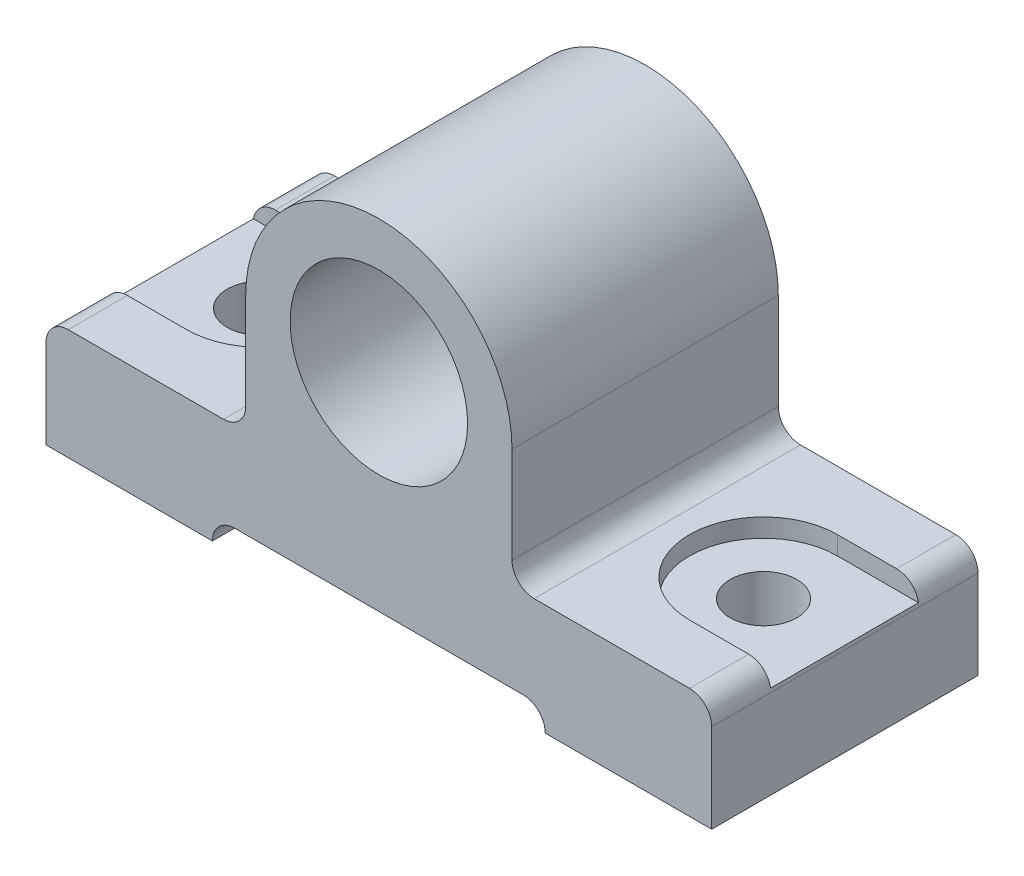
ISO-10303-21;
HEADER;
FILE_DESCRIPTION(('STEP AP214'),'2;1');
FILE_NAME('part.step','',(''),(''),'','','');
FILE_SCHEMA(('AUTOMOTIVE_DESIGN { 1 0 10303 214 1 1 1 1 }'));
ENDSEC;
DATA;
#1=APPLICATION_CONTEXT('core data for automotive mechanical design processes');
#2=APPLICATION_PROTOCOL_DEFINITION('international standard','automotive_design',2000,#1);
#3=PRODUCT_CONTEXT('',#1,'mechanical');
#4=PRODUCT('Part','Part','',(#3));
#5=PRODUCT_RELATED_PRODUCT_CATEGORY('part','',(#4));
#6=PRODUCT_DEFINITION_FORMATION('','',#4);
#7=PRODUCT_DEFINITION_CONTEXT('part definition',#1,'design');
#8=PRODUCT_DEFINITION('design','',#6,#7);
#9=PRODUCT_DEFINITION_SHAPE('','',#8);
#10=(LENGTH_UNIT() NAMED_UNIT(*) SI_UNIT(.MILLI.,.METRE.));
#11=(NAMED_UNIT(*) PLANE_ANGLE_UNIT() SI_UNIT($,.RADIAN.));
#12=(NAMED_UNIT(*) SI_UNIT($,.STERADIAN.) SOLID_ANGLE_UNIT());
#13=UNCERTAINTY_MEASURE_WITH_UNIT(LENGTH_MEASURE(1.E-05),#10,'distance_accuracy_value','');
#14=(GEOMETRIC_REPRESENTATION_CONTEXT(3) GLOBAL_UNCERTAINTY_ASSIGNED_CONTEXT((#13)) GLOBAL_UNIT_ASSIGNED_CONTEXT((#10,
#11,#12)) REPRESENTATION_CONTEXT('',''));
#15=CARTESIAN_POINT('',(0.,0.,0.));
#16=DIRECTION('',(0.,0.,1.));
#17=DIRECTION('',(1.,0.,0.));
#18=AXIS2_PLACEMENT_3D('',#15,#16,#17);
#19=CARTESIAN_POINT('',(0.,0.,-36.));
#20=DIRECTION('',(0.,-1.,0.));
#21=DIRECTION('',(0.,0.,-1.));
#22=AXIS2_PLACEMENT_3D('',#19,#20,#21);
#23=PLANE('',#22);
#24=DIRECTION('',(1.,0.,0.));
#25=VECTOR('',#24,1.);
#26=CARTESIAN_POINT('',(0.,0.,0.));
#27=LINE('',#26,#25);
#28=CARTESIAN_POINT('',(0.,0.,0.));
#29=VERTEX_POINT('',#28);
#30=CARTESIAN_POINT('',(22.5,0.,0.));
#31=VERTEX_POINT('',#30);
#32=EDGE_CURVE('E258',#29,#31,#27,.T.);
#33=ORIENTED_EDGE('',*,*,#32,.F.);
#34=DIRECTION('',(0.,0.,1.));
#35=VECTOR('',#34,1.);
#36=CARTESIAN_POINT('',(0.,0.,-36.));
#37=LINE('',#36,#35);
#38=CARTESIAN_POINT('',(0.,0.,-36.));
#39=VERTEX_POINT('',#38);
#40=EDGE_CURVE('E312',#39,#29,#37,.T.);
#41=ORIENTED_EDGE('',*,*,#40,.F.);
#42=DIRECTION('',(1.,0.,0.));
#43=VECTOR('',#42,1.);
#44=CARTESIAN_POINT('',(0.,0.,-36.));
#45=LINE('',#44,#43);
#46=CARTESIAN_POINT('',(22.5,0.,-36.));
#47=VERTEX_POINT('',#46);
#48=EDGE_CURVE('E286',#39,#47,#45,.T.);
#49=ORIENTED_EDGE('',*,*,#48,.T.);
#50=DIRECTION('',(0.,0.,1.));
#51=VECTOR('',#50,1.);
#52=CARTESIAN_POINT('',(22.5,0.,-36.));
#53=LINE('',#52,#51);
#54=EDGE_CURVE('E324',#47,#31,#53,.T.);
#55=ORIENTED_EDGE('',*,*,#54,.T.);
#56=EDGE_LOOP('',(#33,#41,#49,#55));
#57=FACE_BOUND('',#56,.T.);
#58=CARTESIAN_POINT('',(11.,0.,-18.));
#59=DIRECTION('',(0.,-1.,0.));
#60=DIRECTION('',(0.,0.,-1.));
#61=AXIS2_PLACEMENT_3D('',#58,#59,#60);
#62=CIRCLE('',#61,4.5);
#63=CARTESIAN_POINT('',(11.,0.,-22.5));
#64=VERTEX_POINT('',#63);
#65=EDGE_CURVE('E207',#64,#64,#62,.T.);
#66=ORIENTED_EDGE('',*,*,#65,.F.);
#67=EDGE_LOOP('',(#66));
#68=FACE_BOUND('',#67,.T.);
#69=ADVANCED_FACE('F26',(#57,#68),#23,.T.);
#70=CARTESIAN_POINT('',(11.,12.5,-18.));
#71=DIRECTION('',(0.,1.,0.));
#72=DIRECTION('',(0.,0.,1.));
#73=AXIS2_PLACEMENT_3D('',#70,#71,#72);
#74=PLANE('',#73);
#75=DIRECTION('',(-1.,0.,0.));
#76=VECTOR('',#75,1.);
#77=CARTESIAN_POINT('',(0.,12.5,-8.));
#78=LINE('',#77,#76);
#79=CARTESIAN_POINT('',(11.,12.5,-8.));
#80=VERTEX_POINT('',#79);
#81=CARTESIAN_POINT('',(0.0419601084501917,12.5,-8.));
#82=VERTEX_POINT('',#81);
#83=EDGE_CURVE('E213',#80,#82,#78,.T.);
#84=ORIENTED_EDGE('',*,*,#83,.F.);
#85=CARTESIAN_POINT('',(11.,12.5,-18.));
#86=DIRECTION('',(0.,-1.,0.));
#87=DIRECTION('',(0.,0.,1.));
#88=AXIS2_PLACEMENT_3D('',#85,#86,#87);
#89=CIRCLE('',#88,10.);
#90=CARTESIAN_POINT('',(11.,12.5,-28.));
#91=VERTEX_POINT('',#90);
#92=EDGE_CURVE('E195',#91,#80,#89,.T.);
#93=ORIENTED_EDGE('',*,*,#92,.F.);
#94=DIRECTION('',(1.,0.,0.));
#95=VECTOR('',#94,1.);
#96=CARTESIAN_POINT('',(0.,12.5,-28.));
#97=LINE('',#96,#95);
#98=CARTESIAN_POINT('',(0.0419601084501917,12.5,-28.));
#99=VERTEX_POINT('',#98);
#100=EDGE_CURVE('E41',#99,#91,#97,.T.);
#101=ORIENTED_EDGE('',*,*,#100,.F.);
#102=DIRECTION('',(0.,0.,1.));
#103=VECTOR('',#102,1.);
#104=CARTESIAN_POINT('',(0.0419601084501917,12.5,-36.));
#105=LINE('',#104,#103);
#106=EDGE_CURVE('E386',#82,#99,#105,.F.);
#107=ORIENTED_EDGE('',*,*,#106,.F.);
#108=EDGE_LOOP('',(#84,#93,#101,#107));
#109=FACE_BOUND('',#108,.T.);
#110=CARTESIAN_POINT('',(11.,12.5,-18.));
#111=DIRECTION('',(0.,-1.,0.));
#112=DIRECTION('',(0.,0.,1.));
#113=AXIS2_PLACEMENT_3D('',#110,#111,#112);
#114=CIRCLE('',#113,4.5);
#115=CARTESIAN_POINT('',(11.,12.5,-13.5));
#116=VERTEX_POINT('',#115);
#117=EDGE_CURVE('E470',#116,#116,#114,.T.);
#118=ORIENTED_EDGE('',*,*,#117,.T.);
#119=EDGE_LOOP('',(#118));
#120=FACE_BOUND('',#119,.T.);
#121=ADVANCED_FACE('F464',(#109,#120),#74,.T.);
#122=CARTESIAN_POINT('',(0.,15.,-36.));
#123=DIRECTION('',(0.,1.,0.));
#124=DIRECTION('',(0.,0.,1.));
#125=AXIS2_PLACEMENT_3D('',#122,#123,#124);
#126=PLANE('',#125);
#127=DIRECTION('',(0.,0.,1.));
#128=VECTOR('',#127,1.);
#129=CARTESIAN_POINT('',(3.,15.,-36.));
#130=LINE('',#129,#128);
#131=CARTESIAN_POINT('',(3.,15.,-36.));
#132=VERTEX_POINT('',#131);
#133=CARTESIAN_POINT('',(3.,15.,-28.));
#134=VERTEX_POINT('',#133);
#135=EDGE_CURVE('E352',#132,#134,#130,.T.);
#136=ORIENTED_EDGE('',*,*,#135,.T.);
#137=DIRECTION('',(1.,0.,0.));
#138=VECTOR('',#137,1.);
#139=CARTESIAN_POINT('',(0.,15.,-28.));
#140=LINE('',#139,#138);
#141=CARTESIAN_POINT('',(11.,15.,-28.));
#142=VERTEX_POINT('',#141);
#143=EDGE_CURVE('E211',#134,#142,#140,.T.);
#144=ORIENTED_EDGE('',*,*,#143,.T.);
#145=CARTESIAN_POINT('',(11.,15.,-18.));
#146=DIRECTION('',(0.,-1.,0.));
#147=DIRECTION('',(0.,0.,1.));
#148=AXIS2_PLACEMENT_3D('',#145,#146,#147);
#149=CIRCLE('',#148,10.);
#150=CARTESIAN_POINT('',(11.,15.,-8.));
#151=VERTEX_POINT('',#150);
#152=EDGE_CURVE('E193',#142,#151,#149,.T.);
#153=ORIENTED_EDGE('',*,*,#152,.T.);
#154=DIRECTION('',(-1.,0.,0.));
#155=VECTOR('',#154,1.);
#156=CARTESIAN_POINT('',(0.,15.,-8.));
#157=LINE('',#156,#155);
#158=CARTESIAN_POINT('',(3.,15.,-8.));
#159=VERTEX_POINT('',#158);
#160=EDGE_CURVE('E202',#151,#159,#157,.T.);
#161=ORIENTED_EDGE('',*,*,#160,.T.);
#162=CARTESIAN_POINT('',(3.,15.,0.));
#163=VERTEX_POINT('',#162);
#164=EDGE_CURVE('E351',#159,#163,#130,.T.);
#165=ORIENTED_EDGE('',*,*,#164,.T.);
#166=DIRECTION('',(-1.,0.,0.));
#167=VECTOR('',#166,1.);
#168=CARTESIAN_POINT('',(0.,15.,0.));
#169=LINE('',#168,#167);
#170=CARTESIAN_POINT('',(24.,15.,0.));
#171=VERTEX_POINT('',#170);
#172=EDGE_CURVE('E281',#171,#163,#169,.T.);
#173=ORIENTED_EDGE('',*,*,#172,.F.);
#174=DIRECTION('',(0.,0.,1.));
#175=VECTOR('',#174,1.);
#176=CARTESIAN_POINT('',(24.,15.,-36.));
#177=LINE('',#176,#175);
#178=CARTESIAN_POINT('',(24.,15.,-36.));
#179=VERTEX_POINT('',#178);
#180=EDGE_CURVE('E354',#171,#179,#177,.F.);
#181=ORIENTED_EDGE('',*,*,#180,.T.);
#182=DIRECTION('',(-1.,0.,0.));
#183=VECTOR('',#182,1.);
#184=CARTESIAN_POINT('',(0.,15.,-36.));
#185=LINE('',#184,#183);
#186=EDGE_CURVE('E309',#179,#132,#185,.T.);
#187=ORIENTED_EDGE('',*,*,#186,.T.);
#188=EDGE_LOOP('',(#136,#144,#153,#161,#165,#173,#181,#187));
#189=FACE_BOUND('',#188,.T.);
#190=ADVANCED_FACE('F210',(#189),#126,.T.);
#191=CARTESIAN_POINT('',(3.,12.,-36.));
#192=DIRECTION('',(0.,0.,1.));
#193=DIRECTION('',(1.,0.,0.));
#194=AXIS2_PLACEMENT_3D('',#191,#192,#193);
#195=CYLINDRICAL_SURFACE('',#194,3.);
#196=ORIENTED_EDGE('',*,*,#106,.T.);
#197=CARTESIAN_POINT('',(3.,12.,-28.));
#198=DIRECTION('',(0.,0.,1.));
#199=DIRECTION('',(1.,0.,0.));
#200=AXIS2_PLACEMENT_3D('',#197,#198,#199);
#201=CIRCLE('',#200,3.);
#202=EDGE_CURVE('E11',#99,#134,#201,.F.);
#203=ORIENTED_EDGE('',*,*,#202,.T.);
#204=ORIENTED_EDGE('',*,*,#135,.F.);
#205=CARTESIAN_POINT('',(3.,12.,-36.));
#206=DIRECTION('',(0.,0.,1.));
#207=DIRECTION('',(1.,0.,0.));
#208=AXIS2_PLACEMENT_3D('',#205,#206,#207);
#209=CIRCLE('',#208,3.);
#210=CARTESIAN_POINT('',(0.,12.,-36.));
#211=VERTEX_POINT('',#210);
#212=EDGE_CURVE('E342',#211,#132,#209,.F.);
#213=ORIENTED_EDGE('',*,*,#212,.F.);
#214=DIRECTION('',(0.,0.,1.));
#215=VECTOR('',#214,1.);
#216=CARTESIAN_POINT('',(0.,12.,-36.));
#217=LINE('',#216,#215);
#218=CARTESIAN_POINT('',(0.,12.,0.));
#219=VERTEX_POINT('',#218);
#220=EDGE_CURVE('E356',#219,#211,#217,.F.);
#221=ORIENTED_EDGE('',*,*,#220,.F.);
#222=CARTESIAN_POINT('',(3.,12.,0.));
#223=DIRECTION('',(0.,0.,1.));
#224=DIRECTION('',(1.,0.,0.));
#225=AXIS2_PLACEMENT_3D('',#222,#223,#224);
#226=CIRCLE('',#225,3.);
#227=EDGE_CURVE('E331',#163,#219,#226,.T.);
#228=ORIENTED_EDGE('',*,*,#227,.F.);
#229=ORIENTED_EDGE('',*,*,#164,.F.);
#230=CARTESIAN_POINT('',(3.,12.,-8.));
#231=DIRECTION('',(0.,0.,-1.));
#232=DIRECTION('',(-1.,0.,0.));
#233=AXIS2_PLACEMENT_3D('',#230,#231,#232);
#234=CIRCLE('',#233,3.);
#235=EDGE_CURVE('E34',#159,#82,#234,.F.);
#236=ORIENTED_EDGE('',*,*,#235,.T.);
#237=EDGE_LOOP('',(#196,#203,#204,#213,#221,#228,#229,#236));
#238=FACE_BOUND('',#237,.T.);
#239=ADVANCED_FACE('F389',(#238),#195,.T.);
#240=CARTESIAN_POINT('',(0.,0.,-36.));
#241=DIRECTION('',(-1.,0.,0.));
#242=DIRECTION('',(0.,0.,1.));
#243=AXIS2_PLACEMENT_3D('',#240,#241,#242);
#244=PLANE('',#243);
#245=DIRECTION('',(0.,-1.,0.));
#246=VECTOR('',#245,1.);
#247=CARTESIAN_POINT('',(0.,0.,0.));
#248=LINE('',#247,#246);
#249=EDGE_CURVE('E256',#219,#29,#248,.T.);
#250=ORIENTED_EDGE('',*,*,#249,.F.);
#251=ORIENTED_EDGE('',*,*,#220,.T.);
#252=DIRECTION('',(0.,-1.,0.));
#253=VECTOR('',#252,1.);
#254=CARTESIAN_POINT('',(0.,0.,-36.));
#255=LINE('',#254,#253);
#256=EDGE_CURVE('E284',#211,#39,#255,.T.);
#257=ORIENTED_EDGE('',*,*,#256,.T.);
#258=ORIENTED_EDGE('',*,*,#40,.T.);
#259=EDGE_LOOP('',(#250,#251,#257,#258));
#260=FACE_BOUND('',#259,.T.);
#261=ADVANCED_FACE('F28',(#260),#244,.T.);
#262=CARTESIAN_POINT('',(27.,15.,-36.));
#263=DIRECTION('',(-1.,0.,0.));
#264=DIRECTION('',(0.,0.,1.));
#265=AXIS2_PLACEMENT_3D('',#262,#263,#264);
#266=PLANE('',#265);
#267=DIRECTION('',(0.,-1.,0.));
#268=VECTOR('',#267,1.);
#269=CARTESIAN_POINT('',(27.,15.,-36.));
#270=LINE('',#269,#268);
#271=CARTESIAN_POINT('',(27.,31.,-36.));
#272=VERTEX_POINT('',#271);
#273=CARTESIAN_POINT('',(27.,18.,-36.));
#274=VERTEX_POINT('',#273);
#275=EDGE_CURVE('E306',#272,#274,#270,.T.);
#276=ORIENTED_EDGE('',*,*,#275,.T.);
#277=DIRECTION('',(0.,0.,1.));
#278=VECTOR('',#277,1.);
#279=CARTESIAN_POINT('',(27.,18.,0.));
#280=LINE('',#279,#278);
#281=CARTESIAN_POINT('',(27.,18.,0.));
#282=VERTEX_POINT('',#281);
#283=EDGE_CURVE('E348',#274,#282,#280,.T.);
#284=ORIENTED_EDGE('',*,*,#283,.T.);
#285=DIRECTION('',(0.,-1.,0.));
#286=VECTOR('',#285,1.);
#287=CARTESIAN_POINT('',(27.,15.,0.));
#288=LINE('',#287,#286);
#289=CARTESIAN_POINT('',(27.,31.,0.));
#290=VERTEX_POINT('',#289);
#291=EDGE_CURVE('E278',#290,#282,#288,.T.);
#292=ORIENTED_EDGE('',*,*,#291,.F.);
#293=DIRECTION('',(0.,0.,1.));
#294=VECTOR('',#293,1.);
#295=CARTESIAN_POINT('',(27.,31.,-36.));
#296=LINE('',#295,#294);
#297=EDGE_CURVE('E313',#272,#290,#296,.T.);
#298=ORIENTED_EDGE('',*,*,#297,.F.);
#299=EDGE_LOOP('',(#276,#284,#292,#298));
#300=FACE_BOUND('',#299,.T.);
#301=ADVANCED_FACE('F406',(#300),#266,.T.);
#302=CARTESIAN_POINT('',(45.,31.,-36.));
#303=DIRECTION('',(0.,0.,1.));
#304=DIRECTION('',(1.,0.,0.));
#305=AXIS2_PLACEMENT_3D('',#302,#303,#304);
#306=CYLINDRICAL_SURFACE('',#305,18.);
#307=CARTESIAN_POINT('',(45.,31.,0.));
#308=DIRECTION('',(0.,0.,1.));
#309=DIRECTION('',(1.,0.,0.));
#310=AXIS2_PLACEMENT_3D('',#307,#308,#309);
#311=CIRCLE('',#310,18.);
#312=CARTESIAN_POINT('',(63.,31.,0.));
#313=VERTEX_POINT('',#312);
#314=EDGE_CURVE('E275',#313,#290,#311,.T.);
#315=ORIENTED_EDGE('',*,*,#314,.F.);
#316=DIRECTION('',(0.,0.,1.));
#317=VECTOR('',#316,1.);
#318=CARTESIAN_POINT('',(63.,31.,-36.));
#319=LINE('',#318,#317);
#320=CARTESIAN_POINT('',(63.,31.,-36.));
#321=VERTEX_POINT('',#320);
#322=EDGE_CURVE('E316',#321,#313,#319,.T.);
#323=ORIENTED_EDGE('',*,*,#322,.F.);
#324=CARTESIAN_POINT('',(45.,31.,-36.));
#325=DIRECTION('',(0.,0.,1.));
#326=DIRECTION('',(1.,0.,0.));
#327=AXIS2_PLACEMENT_3D('',#324,#325,#326);
#328=CIRCLE('',#327,18.);
#329=EDGE_CURVE('E303',#321,#272,#328,.T.);
#330=ORIENTED_EDGE('',*,*,#329,.T.);
#331=ORIENTED_EDGE('',*,*,#297,.T.);
#332=EDGE_LOOP('',(#315,#323,#330,#331));
#333=FACE_BOUND('',#332,.T.);
#334=ADVANCED_FACE('F410',(#333),#306,.T.);
#335=CARTESIAN_POINT('',(63.,31.,-36.));
#336=DIRECTION('',(1.,0.,0.));
#337=DIRECTION('',(0.,0.,-1.));
#338=AXIS2_PLACEMENT_3D('',#335,#336,#337);
#339=PLANE('',#338);
#340=DIRECTION('',(0.,1.,0.));
#341=VECTOR('',#340,1.);
#342=CARTESIAN_POINT('',(63.,31.,0.));
#343=LINE('',#342,#341);
#344=CARTESIAN_POINT('',(63.,18.,0.));
#345=VERTEX_POINT('',#344);
#346=EDGE_CURVE('E273',#345,#313,#343,.T.);
#347=ORIENTED_EDGE('',*,*,#346,.F.);
#348=DIRECTION('',(0.,0.,1.));
#349=VECTOR('',#348,1.);
#350=CARTESIAN_POINT('',(63.,18.,-36.));
#351=LINE('',#350,#349);
#352=CARTESIAN_POINT('',(63.,18.,-36.));
#353=VERTEX_POINT('',#352);
#354=EDGE_CURVE('E346',#345,#353,#351,.F.);
#355=ORIENTED_EDGE('',*,*,#354,.T.);
#356=DIRECTION('',(0.,1.,0.));
#357=VECTOR('',#356,1.);
#358=CARTESIAN_POINT('',(63.,31.,-36.));
#359=LINE('',#358,#357);
#360=EDGE_CURVE('E301',#353,#321,#359,.T.);
#361=ORIENTED_EDGE('',*,*,#360,.T.);
#362=ORIENTED_EDGE('',*,*,#322,.T.);
#363=EDGE_LOOP('',(#347,#355,#361,#362));
#364=FACE_BOUND('',#363,.T.);
#365=ADVANCED_FACE('F491',(#364),#339,.T.);
#366=CARTESIAN_POINT('',(63.,15.,-36.));
#367=DIRECTION('',(0.,1.,0.));
#368=DIRECTION('',(0.,0.,1.));
#369=AXIS2_PLACEMENT_3D('',#366,#367,#368);
#370=PLANE('',#369);
#371=DIRECTION('',(1.,0.,0.));
#372=VECTOR('',#371,1.);
#373=CARTESIAN_POINT('',(90.,15.,-8.));
#374=LINE('',#373,#372);
#375=CARTESIAN_POINT('',(79.,15.,-8.));
#376=VERTEX_POINT('',#375);
#377=CARTESIAN_POINT('',(87.,15.,-8.));
#378=VERTEX_POINT('',#377);
#379=EDGE_CURVE('E232',#376,#378,#374,.T.);
#380=ORIENTED_EDGE('',*,*,#379,.F.);
#381=CARTESIAN_POINT('',(79.,15.,-18.));
#382=DIRECTION('',(0.,1.,0.));
#383=DIRECTION('',(0.,0.,1.));
#384=AXIS2_PLACEMENT_3D('',#381,#382,#383);
#385=CIRCLE('',#384,10.);
#386=CARTESIAN_POINT('',(79.,15.,-28.));
#387=VERTEX_POINT('',#386);
#388=EDGE_CURVE('E229',#387,#376,#385,.T.);
#389=ORIENTED_EDGE('',*,*,#388,.F.);
#390=DIRECTION('',(-1.,0.,0.));
#391=VECTOR('',#390,1.);
#392=CARTESIAN_POINT('',(90.,15.,-28.));
#393=LINE('',#392,#391);
#394=CARTESIAN_POINT('',(87.,15.,-28.));
#395=VERTEX_POINT('',#394);
#396=EDGE_CURVE('E225',#395,#387,#393,.T.);
#397=ORIENTED_EDGE('',*,*,#396,.F.);
#398=DIRECTION('',(0.,0.,1.));
#399=VECTOR('',#398,1.);
#400=CARTESIAN_POINT('',(87.,15.,-36.));
#401=LINE('',#400,#399);
#402=CARTESIAN_POINT('',(87.,15.,-36.));
#403=VERTEX_POINT('',#402);
#404=EDGE_CURVE('E338',#395,#403,#401,.F.);
#405=ORIENTED_EDGE('',*,*,#404,.T.);
#406=DIRECTION('',(-1.,0.,0.));
#407=VECTOR('',#406,1.);
#408=CARTESIAN_POINT('',(63.,15.,-36.));
#409=LINE('',#408,#407);
#410=CARTESIAN_POINT('',(66.,15.,-36.));
#411=VERTEX_POINT('',#410);
#412=EDGE_CURVE('E298',#403,#411,#409,.T.);
#413=ORIENTED_EDGE('',*,*,#412,.T.);
#414=DIRECTION('',(0.,0.,1.));
#415=VECTOR('',#414,1.);
#416=CARTESIAN_POINT('',(66.,15.,0.));
#417=LINE('',#416,#415);
#418=CARTESIAN_POINT('',(66.,15.,0.));
#419=VERTEX_POINT('',#418);
#420=EDGE_CURVE('E335',#411,#419,#417,.T.);
#421=ORIENTED_EDGE('',*,*,#420,.T.);
#422=DIRECTION('',(-1.,0.,0.));
#423=VECTOR('',#422,1.);
#424=CARTESIAN_POINT('',(63.,15.,0.));
#425=LINE('',#424,#423);
#426=CARTESIAN_POINT('',(87.,15.,0.));
#427=VERTEX_POINT('',#426);
#428=EDGE_CURVE('E270',#427,#419,#425,.T.);
#429=ORIENTED_EDGE('',*,*,#428,.F.);
#430=EDGE_CURVE('E339',#427,#378,#401,.F.);
#431=ORIENTED_EDGE('',*,*,#430,.T.);
#432=EDGE_LOOP('',(#380,#389,#397,#405,#413,#421,#429,#431));
#433=FACE_BOUND('',#432,.T.);
#434=ADVANCED_FACE('F422',(#433),#370,.T.);
#435=CARTESIAN_POINT('',(90.,15.,-36.));
#436=DIRECTION('',(1.,0.,0.));
#437=DIRECTION('',(0.,0.,-1.));
#438=AXIS2_PLACEMENT_3D('',#435,#436,#437);
#439=PLANE('',#438);
#440=DIRECTION('',(0.,1.,0.));
#441=VECTOR('',#440,1.);
#442=CARTESIAN_POINT('',(90.,15.,-36.));
#443=LINE('',#442,#441);
#444=CARTESIAN_POINT('',(90.,0.,-36.));
#445=VERTEX_POINT('',#444);
#446=CARTESIAN_POINT('',(90.,12.,-36.));
#447=VERTEX_POINT('',#446);
#448=EDGE_CURVE('E295',#445,#447,#443,.T.);
#449=ORIENTED_EDGE('',*,*,#448,.T.);
#450=DIRECTION('',(0.,0.,1.));
#451=VECTOR('',#450,1.);
#452=CARTESIAN_POINT('',(90.,12.,-36.));
#453=LINE('',#452,#451);
#454=CARTESIAN_POINT('',(90.,12.,0.));
#455=VERTEX_POINT('',#454);
#456=EDGE_CURVE('E315',#447,#455,#453,.T.);
#457=ORIENTED_EDGE('',*,*,#456,.T.);
#458=DIRECTION('',(0.,1.,0.));
#459=VECTOR('',#458,1.);
#460=CARTESIAN_POINT('',(90.,15.,0.));
#461=LINE('',#460,#459);
#462=CARTESIAN_POINT('',(90.,0.,0.));
#463=VERTEX_POINT('',#462);
#464=EDGE_CURVE('E267',#463,#455,#461,.T.);
#465=ORIENTED_EDGE('',*,*,#464,.F.);
#466=DIRECTION('',(0.,0.,1.));
#467=VECTOR('',#466,1.);
#468=CARTESIAN_POINT('',(90.,0.,-36.));
#469=LINE('',#468,#467);
#470=EDGE_CURVE('E319',#445,#463,#469,.T.);
#471=ORIENTED_EDGE('',*,*,#470,.F.);
#472=EDGE_LOOP('',(#449,#457,#465,#471));
#473=FACE_BOUND('',#472,.T.);
#474=ADVANCED_FACE('F433',(#473),#439,.T.);
#475=CARTESIAN_POINT('',(90.,0.,-36.));
#476=DIRECTION('',(0.,-1.,0.));
#477=DIRECTION('',(1.,0.,0.));
#478=AXIS2_PLACEMENT_3D('',#475,#476,#477);
#479=PLANE('',#478);
#480=CARTESIAN_POINT('',(79.,0.,-18.));
#481=DIRECTION('',(0.,-1.,0.));
#482=DIRECTION('',(1.,0.,0.));
#483=AXIS2_PLACEMENT_3D('',#480,#481,#482);
#484=CIRCLE('',#483,4.5);
#485=CARTESIAN_POINT('',(83.5,0.,-18.));
#486=VERTEX_POINT('',#485);
#487=EDGE_CURVE('E220',#486,#486,#484,.F.);
#488=ORIENTED_EDGE('',*,*,#487,.T.);
#489=EDGE_LOOP('',(#488));
#490=FACE_BOUND('',#489,.T.);
#491=DIRECTION('',(1.,0.,0.));
#492=VECTOR('',#491,1.);
#493=CARTESIAN_POINT('',(90.,0.,0.));
#494=LINE('',#493,#492);
#495=CARTESIAN_POINT('',(67.5,0.,0.));
#496=VERTEX_POINT('',#495);
#497=EDGE_CURVE('E264',#496,#463,#494,.T.);
#498=ORIENTED_EDGE('',*,*,#497,.F.);
#499=DIRECTION('',(0.,0.,1.));
#500=VECTOR('',#499,1.);
#501=CARTESIAN_POINT('',(67.5,0.,-36.));
#502=LINE('',#501,#500);
#503=CARTESIAN_POINT('',(67.5,0.,-36.));
#504=VERTEX_POINT('',#503);
#505=EDGE_CURVE('E321',#504,#496,#502,.T.);
#506=ORIENTED_EDGE('',*,*,#505,.F.);
#507=DIRECTION('',(1.,0.,0.));
#508=VECTOR('',#507,1.);
#509=CARTESIAN_POINT('',(90.,0.,-36.));
#510=LINE('',#509,#508);
#511=EDGE_CURVE('E292',#504,#445,#510,.T.);
#512=ORIENTED_EDGE('',*,*,#511,.T.);
#513=ORIENTED_EDGE('',*,*,#470,.T.);
#514=EDGE_LOOP('',(#498,#506,#512,#513));
#515=FACE_BOUND('',#514,.T.);
#516=ADVANCED_FACE('F439',(#490,#515),#479,.T.);
#517=CARTESIAN_POINT('',(22.5,3.,-36.));
#518=DIRECTION('',(0.,-1.,0.));
#519=DIRECTION('',(0.,0.,-1.));
#520=AXIS2_PLACEMENT_3D('',#517,#518,#519);
#521=PLANE('',#520);
#522=DIRECTION('',(1.,0.,0.));
#523=VECTOR('',#522,1.);
#524=CARTESIAN_POINT('',(22.5,3.,0.));
#525=LINE('',#524,#523);
#526=CARTESIAN_POINT('',(25.5,3.,0.));
#527=VERTEX_POINT('',#526);
#528=CARTESIAN_POINT('',(64.5,3.,0.));
#529=VERTEX_POINT('',#528);
#530=EDGE_CURVE('E261',#527,#529,#525,.T.);
#531=ORIENTED_EDGE('',*,*,#530,.F.);
#532=DIRECTION('',(0.,0.,1.));
#533=VECTOR('',#532,1.);
#534=CARTESIAN_POINT('',(25.5,3.,-36.));
#535=LINE('',#534,#533);
#536=CARTESIAN_POINT('',(25.5,3.,-36.));
#537=VERTEX_POINT('',#536);
#538=EDGE_CURVE('E361',#527,#537,#535,.F.);
#539=ORIENTED_EDGE('',*,*,#538,.T.);
#540=DIRECTION('',(1.,0.,0.));
#541=VECTOR('',#540,1.);
#542=CARTESIAN_POINT('',(22.5,3.,-36.));
#543=LINE('',#542,#541);
#544=CARTESIAN_POINT('',(64.5,3.,-36.));
#545=VERTEX_POINT('',#544);
#546=EDGE_CURVE('E289',#537,#545,#543,.T.);
#547=ORIENTED_EDGE('',*,*,#546,.T.);
#548=DIRECTION('',(0.,0.,1.));
#549=VECTOR('',#548,1.);
#550=CARTESIAN_POINT('',(64.5,3.,0.));
#551=LINE('',#550,#549);
#552=EDGE_CURVE('E358',#545,#529,#551,.T.);
#553=ORIENTED_EDGE('',*,*,#552,.T.);
#554=EDGE_LOOP('',(#531,#539,#547,#553));
#555=FACE_BOUND('',#554,.T.);
#556=ADVANCED_FACE('F447',(#555),#521,.T.);
#557=CARTESIAN_POINT('',(45.,31.,-36.));
#558=DIRECTION('',(0.,0.,1.));
#559=DIRECTION('',(1.,0.,0.));
#560=AXIS2_PLACEMENT_3D('',#557,#558,#559);
#561=PLANE('',#560);
#562=CARTESIAN_POINT('',(45.,31.,-36.));
#563=DIRECTION('',(0.,0.,1.));
#564=DIRECTION('',(1.,0.,0.));
#565=AXIS2_PLACEMENT_3D('',#562,#563,#564);
#566=CIRCLE('',#565,6.5);
#567=CARTESIAN_POINT('',(51.5,31.,-36.));
#568=VERTEX_POINT('',#567);
#569=EDGE_CURVE('E247',#568,#568,#566,.T.);
#570=ORIENTED_EDGE('',*,*,#569,.T.);
#571=EDGE_LOOP('',(#570));
#572=FACE_BOUND('',#571,.T.);
#573=ORIENTED_EDGE('',*,*,#412,.F.);
#574=CARTESIAN_POINT('',(87.,12.,-36.));
#575=DIRECTION('',(0.,0.,1.));
#576=DIRECTION('',(1.,0.,0.));
#577=AXIS2_PLACEMENT_3D('',#574,#575,#576);
#578=CIRCLE('',#577,3.);
#579=EDGE_CURVE('E344',#403,#447,#578,.F.);
#580=ORIENTED_EDGE('',*,*,#579,.T.);
#581=ORIENTED_EDGE('',*,*,#448,.F.);
#582=ORIENTED_EDGE('',*,*,#511,.F.);
#583=CARTESIAN_POINT('',(64.5,0.,-36.));
#584=DIRECTION('',(0.,0.,1.));
#585=DIRECTION('',(1.,0.,0.));
#586=AXIS2_PLACEMENT_3D('',#583,#584,#585);
#587=CIRCLE('',#586,3.);
#588=EDGE_CURVE('E377',#504,#545,#587,.T.);
#589=ORIENTED_EDGE('',*,*,#588,.T.);
#590=ORIENTED_EDGE('',*,*,#546,.F.);
#591=CARTESIAN_POINT('',(25.5,0.,-36.));
#592=DIRECTION('',(0.,0.,1.));
#593=DIRECTION('',(1.,0.,0.));
#594=AXIS2_PLACEMENT_3D('',#591,#592,#593);
#595=CIRCLE('',#594,3.);
#596=EDGE_CURVE('E373',#537,#47,#595,.T.);
#597=ORIENTED_EDGE('',*,*,#596,.T.);
#598=ORIENTED_EDGE('',*,*,#48,.F.);
#599=ORIENTED_EDGE('',*,*,#256,.F.);
#600=ORIENTED_EDGE('',*,*,#212,.T.);
#601=ORIENTED_EDGE('',*,*,#186,.F.);
#602=CARTESIAN_POINT('',(24.,18.,-36.));
#603=DIRECTION('',(0.,0.,1.));
#604=DIRECTION('',(1.,0.,0.));
#605=AXIS2_PLACEMENT_3D('',#602,#603,#604);
#606=CIRCLE('',#605,3.);
#607=EDGE_CURVE('E369',#179,#274,#606,.T.);
#608=ORIENTED_EDGE('',*,*,#607,.T.);
#609=ORIENTED_EDGE('',*,*,#275,.F.);
#610=ORIENTED_EDGE('',*,*,#329,.F.);
#611=ORIENTED_EDGE('',*,*,#360,.F.);
#612=CARTESIAN_POINT('',(66.,18.,-36.));
#613=DIRECTION('',(0.,0.,1.));
#614=DIRECTION('',(1.,0.,0.));
#615=AXIS2_PLACEMENT_3D('',#612,#613,#614);
#616=CIRCLE('',#615,3.);
#617=EDGE_CURVE('E365',#353,#411,#616,.T.);
#618=ORIENTED_EDGE('',*,*,#617,.T.);
#619=EDGE_LOOP('',(#573,#580,#581,#582,#589,#590,#597,#598,#599,#600,#601,#608,#609,#610,#611,#618));
#620=FACE_BOUND('',#619,.T.);
#621=ADVANCED_FACE('F403',(#572,#620),#561,.F.);
#622=CARTESIAN_POINT('',(45.,31.,0.));
#623=DIRECTION('',(0.,0.,1.));
#624=DIRECTION('',(1.,0.,0.));
#625=AXIS2_PLACEMENT_3D('',#622,#623,#624);
#626=PLANE('',#625);
#627=CARTESIAN_POINT('',(45.,31.,0.));
#628=DIRECTION('',(0.,0.,1.));
#629=DIRECTION('',(1.,0.,0.));
#630=AXIS2_PLACEMENT_3D('',#627,#628,#629);
#631=CIRCLE('',#630,12.);
#632=CARTESIAN_POINT('',(57.,31.,0.));
#633=VERTEX_POINT('',#632);
#634=EDGE_CURVE('E250',#633,#633,#631,.T.);
#635=ORIENTED_EDGE('',*,*,#634,.F.);
#636=EDGE_LOOP('',(#635));
#637=FACE_BOUND('',#636,.T.);
#638=ORIENTED_EDGE('',*,*,#464,.T.);
#639=CARTESIAN_POINT('',(87.,12.,0.));
#640=DIRECTION('',(0.,0.,1.));
#641=DIRECTION('',(1.,0.,0.));
#642=AXIS2_PLACEMENT_3D('',#639,#640,#641);
#643=CIRCLE('',#642,3.);
#644=EDGE_CURVE('E333',#455,#427,#643,.T.);
#645=ORIENTED_EDGE('',*,*,#644,.T.);
#646=ORIENTED_EDGE('',*,*,#428,.T.);
#647=CARTESIAN_POINT('',(66.,18.,0.));
#648=DIRECTION('',(0.,0.,1.));
#649=DIRECTION('',(1.,0.,0.));
#650=AXIS2_PLACEMENT_3D('',#647,#648,#649);
#651=CIRCLE('',#650,3.);
#652=EDGE_CURVE('E363',#419,#345,#651,.F.);
#653=ORIENTED_EDGE('',*,*,#652,.T.);
#654=ORIENTED_EDGE('',*,*,#346,.T.);
#655=ORIENTED_EDGE('',*,*,#314,.T.);
#656=ORIENTED_EDGE('',*,*,#291,.T.);
#657=CARTESIAN_POINT('',(24.,18.,0.));
#658=DIRECTION('',(0.,0.,1.));
#659=DIRECTION('',(1.,0.,0.));
#660=AXIS2_PLACEMENT_3D('',#657,#658,#659);
#661=CIRCLE('',#660,3.);
#662=EDGE_CURVE('E367',#282,#171,#661,.F.);
#663=ORIENTED_EDGE('',*,*,#662,.T.);
#664=ORIENTED_EDGE('',*,*,#172,.T.);
#665=ORIENTED_EDGE('',*,*,#227,.T.);
#666=ORIENTED_EDGE('',*,*,#249,.T.);
#667=ORIENTED_EDGE('',*,*,#32,.T.);
#668=CARTESIAN_POINT('',(25.5,0.,0.));
#669=DIRECTION('',(0.,0.,1.));
#670=DIRECTION('',(1.,0.,0.));
#671=AXIS2_PLACEMENT_3D('',#668,#669,#670);
#672=CIRCLE('',#671,3.);
#673=EDGE_CURVE('E371',#31,#527,#672,.F.);
#674=ORIENTED_EDGE('',*,*,#673,.T.);
#675=ORIENTED_EDGE('',*,*,#530,.T.);
#676=CARTESIAN_POINT('',(64.5,0.,0.));
#677=DIRECTION('',(0.,0.,1.));
#678=DIRECTION('',(1.,0.,0.));
#679=AXIS2_PLACEMENT_3D('',#676,#677,#678);
#680=CIRCLE('',#679,3.);
#681=EDGE_CURVE('E375',#529,#496,#680,.F.);
#682=ORIENTED_EDGE('',*,*,#681,.T.);
#683=ORIENTED_EDGE('',*,*,#497,.T.);
#684=EDGE_LOOP('',(#638,#645,#646,#653,#654,#655,#656,#663,#664,#665,#666,#667,#674,#675,#682,#683));
#685=FACE_BOUND('',#684,.T.);
#686=ADVANCED_FACE('F424',(#637,#685),#626,.T.);
#687=CARTESIAN_POINT('',(45.,31.,-27.));
#688=DIRECTION('',(0.,0.,1.));
#689=DIRECTION('',(1.,0.,0.));
#690=AXIS2_PLACEMENT_3D('',#687,#688,#689);
#691=CYLINDRICAL_SURFACE('',#690,12.);
#692=CARTESIAN_POINT('',(45.,31.,-27.));
#693=DIRECTION('',(0.,0.,1.));
#694=DIRECTION('',(1.,0.,0.));
#695=AXIS2_PLACEMENT_3D('',#692,#693,#694);
#696=CIRCLE('',#695,12.);
#697=CARTESIAN_POINT('',(57.,31.,-27.));
#698=VERTEX_POINT('',#697);
#699=EDGE_CURVE('E253',#698,#698,#696,.T.);
#700=ORIENTED_EDGE('',*,*,#699,.F.);
#701=EDGE_LOOP('',(#700));
#702=FACE_BOUND('',#701,.T.);
#703=ORIENTED_EDGE('',*,*,#634,.T.);
#704=EDGE_LOOP('',(#703));
#705=FACE_BOUND('',#704,.T.);
#706=ADVANCED_FACE('F505',(#702,#705),#691,.F.);
#707=CARTESIAN_POINT('',(45.,31.,-27.));
#708=DIRECTION('',(0.,0.,1.));
#709=DIRECTION('',(1.,0.,0.));
#710=AXIS2_PLACEMENT_3D('',#707,#708,#709);
#711=PLANE('',#710);
#712=CARTESIAN_POINT('',(45.,31.,-27.));
#713=DIRECTION('',(0.,0.,1.));
#714=DIRECTION('',(1.,0.,0.));
#715=AXIS2_PLACEMENT_3D('',#712,#713,#714);
#716=CIRCLE('',#715,6.5);
#717=CARTESIAN_POINT('',(51.5,31.,-27.));
#718=VERTEX_POINT('',#717);
#719=EDGE_CURVE('E242',#718,#718,#716,.T.);
#720=ORIENTED_EDGE('',*,*,#719,.F.);
#721=EDGE_LOOP('',(#720));
#722=FACE_BOUND('',#721,.T.);
#723=ORIENTED_EDGE('',*,*,#699,.T.);
#724=EDGE_LOOP('',(#723));
#725=FACE_BOUND('',#724,.T.);
#726=ADVANCED_FACE('F509',(#722,#725),#711,.T.);
#727=CARTESIAN_POINT('',(45.,31.,-36.));
#728=DIRECTION('',(0.,0.,1.));
#729=DIRECTION('',(1.,0.,0.));
#730=AXIS2_PLACEMENT_3D('',#727,#728,#729);
#731=CYLINDRICAL_SURFACE('',#730,6.5);
#732=ORIENTED_EDGE('',*,*,#569,.F.);
#733=EDGE_LOOP('',(#732));
#734=FACE_BOUND('',#733,.T.);
#735=ORIENTED_EDGE('',*,*,#719,.T.);
#736=EDGE_LOOP('',(#735));
#737=FACE_BOUND('',#736,.T.);
#738=ADVANCED_FACE('F513',(#734,#737),#731,.F.);
#739=CARTESIAN_POINT('',(87.,12.,-36.));
#740=DIRECTION('',(0.,0.,1.));
#741=DIRECTION('',(1.,0.,0.));
#742=AXIS2_PLACEMENT_3D('',#739,#740,#741);
#743=CYLINDRICAL_SURFACE('',#742,3.);
#744=CARTESIAN_POINT('',(87.,12.,-8.));
#745=DIRECTION('',(0.,0.,1.));
#746=DIRECTION('',(1.,0.,0.));
#747=AXIS2_PLACEMENT_3D('',#744,#745,#746);
#748=CIRCLE('',#747,3.);
#749=CARTESIAN_POINT('',(89.9580398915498,12.5,-8.));
#750=VERTEX_POINT('',#749);
#751=EDGE_CURVE('E384',#378,#750,#748,.F.);
#752=ORIENTED_EDGE('',*,*,#751,.F.);
#753=ORIENTED_EDGE('',*,*,#430,.F.);
#754=ORIENTED_EDGE('',*,*,#644,.F.);
#755=ORIENTED_EDGE('',*,*,#456,.F.);
#756=ORIENTED_EDGE('',*,*,#579,.F.);
#757=ORIENTED_EDGE('',*,*,#404,.F.);
#758=CARTESIAN_POINT('',(87.,12.,-28.));
#759=DIRECTION('',(0.,0.,-1.));
#760=DIRECTION('',(-1.,0.,0.));
#761=AXIS2_PLACEMENT_3D('',#758,#759,#760);
#762=CIRCLE('',#761,3.);
#763=CARTESIAN_POINT('',(89.9580398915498,12.5,-28.));
#764=VERTEX_POINT('',#763);
#765=EDGE_CURVE('E382',#764,#395,#762,.F.);
#766=ORIENTED_EDGE('',*,*,#765,.F.);
#767=DIRECTION('',(0.,0.,1.));
#768=VECTOR('',#767,1.);
#769=CARTESIAN_POINT('',(89.9580398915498,12.5,-36.));
#770=LINE('',#769,#768);
#771=EDGE_CURVE('E379',#764,#750,#770,.T.);
#772=ORIENTED_EDGE('',*,*,#771,.T.);
#773=EDGE_LOOP('',(#752,#753,#754,#755,#756,#757,#766,#772));
#774=FACE_BOUND('',#773,.T.);
#775=ADVANCED_FACE('F430',(#774),#743,.T.);
#776=CARTESIAN_POINT('',(66.,18.,-36.));
#777=DIRECTION('',(0.,0.,-1.));
#778=DIRECTION('',(-1.,0.,0.));
#779=AXIS2_PLACEMENT_3D('',#776,#777,#778);
#780=CYLINDRICAL_SURFACE('',#779,3.);
#781=ORIENTED_EDGE('',*,*,#617,.F.);
#782=ORIENTED_EDGE('',*,*,#354,.F.);
#783=ORIENTED_EDGE('',*,*,#652,.F.);
#784=ORIENTED_EDGE('',*,*,#420,.F.);
#785=EDGE_LOOP('',(#781,#782,#783,#784));
#786=FACE_BOUND('',#785,.T.);
#787=ADVANCED_FACE('F418',(#786),#780,.F.);
#788=CARTESIAN_POINT('',(24.,18.,-36.));
#789=DIRECTION('',(0.,0.,-1.));
#790=DIRECTION('',(-1.,0.,0.));
#791=AXIS2_PLACEMENT_3D('',#788,#789,#790);
#792=CYLINDRICAL_SURFACE('',#791,3.);
#793=ORIENTED_EDGE('',*,*,#607,.F.);
#794=ORIENTED_EDGE('',*,*,#180,.F.);
#795=ORIENTED_EDGE('',*,*,#662,.F.);
#796=ORIENTED_EDGE('',*,*,#283,.F.);
#797=EDGE_LOOP('',(#793,#794,#795,#796));
#798=FACE_BOUND('',#797,.T.);
#799=ADVANCED_FACE('F398',(#798),#792,.F.);
#800=CARTESIAN_POINT('',(25.5,0.,-36.));
#801=DIRECTION('',(0.,0.,-1.));
#802=DIRECTION('',(-1.,0.,0.));
#803=AXIS2_PLACEMENT_3D('',#800,#801,#802);
#804=CYLINDRICAL_SURFACE('',#803,3.);
#805=ORIENTED_EDGE('',*,*,#596,.F.);
#806=ORIENTED_EDGE('',*,*,#538,.F.);
#807=ORIENTED_EDGE('',*,*,#673,.F.);
#808=ORIENTED_EDGE('',*,*,#54,.F.);
#809=EDGE_LOOP('',(#805,#806,#807,#808));
#810=FACE_BOUND('',#809,.T.);
#811=ADVANCED_FACE('F450',(#810),#804,.F.);
#812=CARTESIAN_POINT('',(64.5,0.,-36.));
#813=DIRECTION('',(0.,0.,-1.));
#814=DIRECTION('',(-1.,0.,0.));
#815=AXIS2_PLACEMENT_3D('',#812,#813,#814);
#816=CYLINDRICAL_SURFACE('',#815,3.);
#817=ORIENTED_EDGE('',*,*,#588,.F.);
#818=ORIENTED_EDGE('',*,*,#505,.T.);
#819=ORIENTED_EDGE('',*,*,#681,.F.);
#820=ORIENTED_EDGE('',*,*,#552,.F.);
#821=EDGE_LOOP('',(#817,#818,#819,#820));
#822=FACE_BOUND('',#821,.T.);
#823=ADVANCED_FACE('F441',(#822),#816,.F.);
#824=CARTESIAN_POINT('',(90.,12.5,-8.));
#825=DIRECTION('',(0.,0.,1.));
#826=DIRECTION('',(1.,0.,0.));
#827=AXIS2_PLACEMENT_3D('',#824,#825,#826);
#828=PLANE('',#827);
#829=ORIENTED_EDGE('',*,*,#751,.T.);
#830=DIRECTION('',(1.,0.,0.));
#831=VECTOR('',#830,1.);
#832=CARTESIAN_POINT('',(90.,12.5,-8.));
#833=LINE('',#832,#831);
#834=CARTESIAN_POINT('',(79.,12.5,-8.));
#835=VERTEX_POINT('',#834);
#836=EDGE_CURVE('E49',#835,#750,#833,.T.);
#837=ORIENTED_EDGE('',*,*,#836,.F.);
#838=DIRECTION('',(0.,1.,0.));
#839=VECTOR('',#838,1.);
#840=CARTESIAN_POINT('',(79.,12.5,-8.));
#841=LINE('',#840,#839);
#842=EDGE_CURVE('E240',#835,#376,#841,.T.);
#843=ORIENTED_EDGE('',*,*,#842,.T.);
#844=ORIENTED_EDGE('',*,*,#379,.T.);
#845=EDGE_LOOP('',(#829,#837,#843,#844));
#846=FACE_BOUND('',#845,.T.);
#847=ADVANCED_FACE('F530',(#846),#828,.F.);
#848=CARTESIAN_POINT('',(79.,12.5,-18.));
#849=DIRECTION('',(0.,1.,0.));
#850=DIRECTION('',(0.,0.,1.));
#851=AXIS2_PLACEMENT_3D('',#848,#849,#850);
#852=CYLINDRICAL_SURFACE('',#851,10.);
#853=ORIENTED_EDGE('',*,*,#388,.T.);
#854=ORIENTED_EDGE('',*,*,#842,.F.);
#855=CARTESIAN_POINT('',(79.,12.5,-18.));
#856=DIRECTION('',(0.,1.,0.));
#857=DIRECTION('',(0.,0.,1.));
#858=AXIS2_PLACEMENT_3D('',#855,#856,#857);
#859=CIRCLE('',#858,10.);
#860=CARTESIAN_POINT('',(79.,12.5,-28.));
#861=VERTEX_POINT('',#860);
#862=EDGE_CURVE('E236',#861,#835,#859,.T.);
#863=ORIENTED_EDGE('',*,*,#862,.F.);
#864=DIRECTION('',(0.,1.,0.));
#865=VECTOR('',#864,1.);
#866=CARTESIAN_POINT('',(79.,12.5,-28.));
#867=LINE('',#866,#865);
#868=EDGE_CURVE('E239',#861,#387,#867,.T.);
#869=ORIENTED_EDGE('',*,*,#868,.T.);
#870=EDGE_LOOP('',(#853,#854,#863,#869));
#871=FACE_BOUND('',#870,.T.);
#872=ADVANCED_FACE('F535',(#871),#852,.F.);
#873=CARTESIAN_POINT('',(90.,12.5,-28.));
#874=DIRECTION('',(0.,0.,-1.));
#875=DIRECTION('',(-1.,0.,0.));
#876=AXIS2_PLACEMENT_3D('',#873,#874,#875);
#877=PLANE('',#876);
#878=ORIENTED_EDGE('',*,*,#765,.T.);
#879=ORIENTED_EDGE('',*,*,#396,.T.);
#880=ORIENTED_EDGE('',*,*,#868,.F.);
#881=DIRECTION('',(-1.,0.,0.));
#882=VECTOR('',#881,1.);
#883=CARTESIAN_POINT('',(90.,12.5,-28.));
#884=LINE('',#883,#882);
#885=EDGE_CURVE('E234',#764,#861,#884,.T.);
#886=ORIENTED_EDGE('',*,*,#885,.F.);
#887=EDGE_LOOP('',(#878,#879,#880,#886));
#888=FACE_BOUND('',#887,.T.);
#889=ADVANCED_FACE('F531',(#888),#877,.F.);
#890=CARTESIAN_POINT('',(79.,12.5,-18.));
#891=DIRECTION('',(0.,1.,0.));
#892=DIRECTION('',(0.,0.,1.));
#893=AXIS2_PLACEMENT_3D('',#890,#891,#892);
#894=PLANE('',#893);
#895=CARTESIAN_POINT('',(79.,12.5,-18.));
#896=DIRECTION('',(0.,1.,0.));
#897=DIRECTION('',(0.,0.,1.));
#898=AXIS2_PLACEMENT_3D('',#895,#896,#897);
#899=CIRCLE('',#898,4.5);
#900=CARTESIAN_POINT('',(79.,12.5,-13.5));
#901=VERTEX_POINT('',#900);
#902=EDGE_CURVE('E222',#901,#901,#899,.T.);
#903=ORIENTED_EDGE('',*,*,#902,.F.);
#904=EDGE_LOOP('',(#903));
#905=FACE_BOUND('',#904,.T.);
#906=ORIENTED_EDGE('',*,*,#885,.T.);
#907=ORIENTED_EDGE('',*,*,#862,.T.);
#908=ORIENTED_EDGE('',*,*,#836,.T.);
#909=ORIENTED_EDGE('',*,*,#771,.F.);
#910=EDGE_LOOP('',(#906,#907,#908,#909));
#911=FACE_BOUND('',#910,.T.);
#912=ADVANCED_FACE('F534',(#905,#911),#894,.T.);
#913=CARTESIAN_POINT('',(79.,-0.000999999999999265,-18.));
#914=DIRECTION('',(0.,1.,0.));
#915=DIRECTION('',(0.,0.,1.));
#916=AXIS2_PLACEMENT_3D('',#913,#914,#915);
#917=CYLINDRICAL_SURFACE('',#916,4.5);
#918=ORIENTED_EDGE('',*,*,#487,.F.);
#919=EDGE_LOOP('',(#918));
#920=FACE_BOUND('',#919,.T.);
#921=ORIENTED_EDGE('',*,*,#902,.T.);
#922=EDGE_LOOP('',(#921));
#923=FACE_BOUND('',#922,.T.);
#924=ADVANCED_FACE('F545',(#920,#923),#917,.F.);
#925=CARTESIAN_POINT('',(0.,12.5,-28.));
#926=DIRECTION('',(0.,0.,1.));
#927=DIRECTION('',(1.,0.,0.));
#928=AXIS2_PLACEMENT_3D('',#925,#926,#927);
#929=PLANE('',#928);
#930=ORIENTED_EDGE('',*,*,#100,.T.);
#931=DIRECTION('',(0.,1.,0.));
#932=VECTOR('',#931,1.);
#933=CARTESIAN_POINT('',(11.,12.5,-28.));
#934=LINE('',#933,#932);
#935=EDGE_CURVE('E199',#91,#142,#934,.T.);
#936=ORIENTED_EDGE('',*,*,#935,.T.);
#937=ORIENTED_EDGE('',*,*,#143,.F.);
#938=ORIENTED_EDGE('',*,*,#202,.F.);
#939=EDGE_LOOP('',(#930,#936,#937,#938));
#940=FACE_BOUND('',#939,.T.);
#941=ADVANCED_FACE('F463',(#940),#929,.T.);
#942=CARTESIAN_POINT('',(11.,12.5,-18.));
#943=DIRECTION('',(0.,1.,0.));
#944=DIRECTION('',(0.,0.,1.));
#945=AXIS2_PLACEMENT_3D('',#942,#943,#944);
#946=CYLINDRICAL_SURFACE('',#945,10.);
#947=ORIENTED_EDGE('',*,*,#152,.F.);
#948=ORIENTED_EDGE('',*,*,#935,.F.);
#949=ORIENTED_EDGE('',*,*,#92,.T.);
#950=DIRECTION('',(0.,1.,0.));
#951=VECTOR('',#950,1.);
#952=CARTESIAN_POINT('',(11.,12.5,-8.));
#953=LINE('',#952,#951);
#954=EDGE_CURVE('E188',#80,#151,#953,.T.);
#955=ORIENTED_EDGE('',*,*,#954,.T.);
#956=EDGE_LOOP('',(#947,#948,#949,#955));
#957=FACE_BOUND('',#956,.T.);
#958=ADVANCED_FACE('F190',(#957),#946,.F.);
#959=CARTESIAN_POINT('',(0.,12.5,-8.));
#960=DIRECTION('',(0.,0.,-1.));
#961=DIRECTION('',(-1.,0.,0.));
#962=AXIS2_PLACEMENT_3D('',#959,#960,#961);
#963=PLANE('',#962);
#964=ORIENTED_EDGE('',*,*,#160,.F.);
#965=ORIENTED_EDGE('',*,*,#954,.F.);
#966=ORIENTED_EDGE('',*,*,#83,.T.);
#967=ORIENTED_EDGE('',*,*,#235,.F.);
#968=EDGE_LOOP('',(#964,#965,#966,#967));
#969=FACE_BOUND('',#968,.T.);
#970=ADVANCED_FACE('F203',(#969),#963,.T.);
#971=CARTESIAN_POINT('',(11.,-0.000999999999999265,-18.));
#972=DIRECTION('',(0.,1.,0.));
#973=DIRECTION('',(0.,0.,1.));
#974=AXIS2_PLACEMENT_3D('',#971,#972,#973);
#975=CYLINDRICAL_SURFACE('',#974,4.5);
#976=ORIENTED_EDGE('',*,*,#65,.T.);
#977=EDGE_LOOP('',(#976));
#978=FACE_BOUND('',#977,.T.);
#979=ORIENTED_EDGE('',*,*,#117,.F.);
#980=EDGE_LOOP('',(#979));
#981=FACE_BOUND('',#980,.T.);
#982=ADVANCED_FACE('F476',(#978,#981),#975,.F.);
#983=CLOSED_SHELL('',(#69,#121,#190,#239,#261,#301,#334,#365,#434,#474,#516,#556,#621,#686,#706,
#726,#738,#775,#787,#799,#811,#823,#847,#872,#889,#912,#924,#941,#958,#970,#982));
#984=MANIFOLD_SOLID_BREP('B2',#983);
#985=ADVANCED_BREP_SHAPE_REPRESENTATION('',(#18,#984),#14);
#986=SHAPE_DEFINITION_REPRESENTATION(#9,#985);
ENDSEC;
END-ISO-10303-21;
